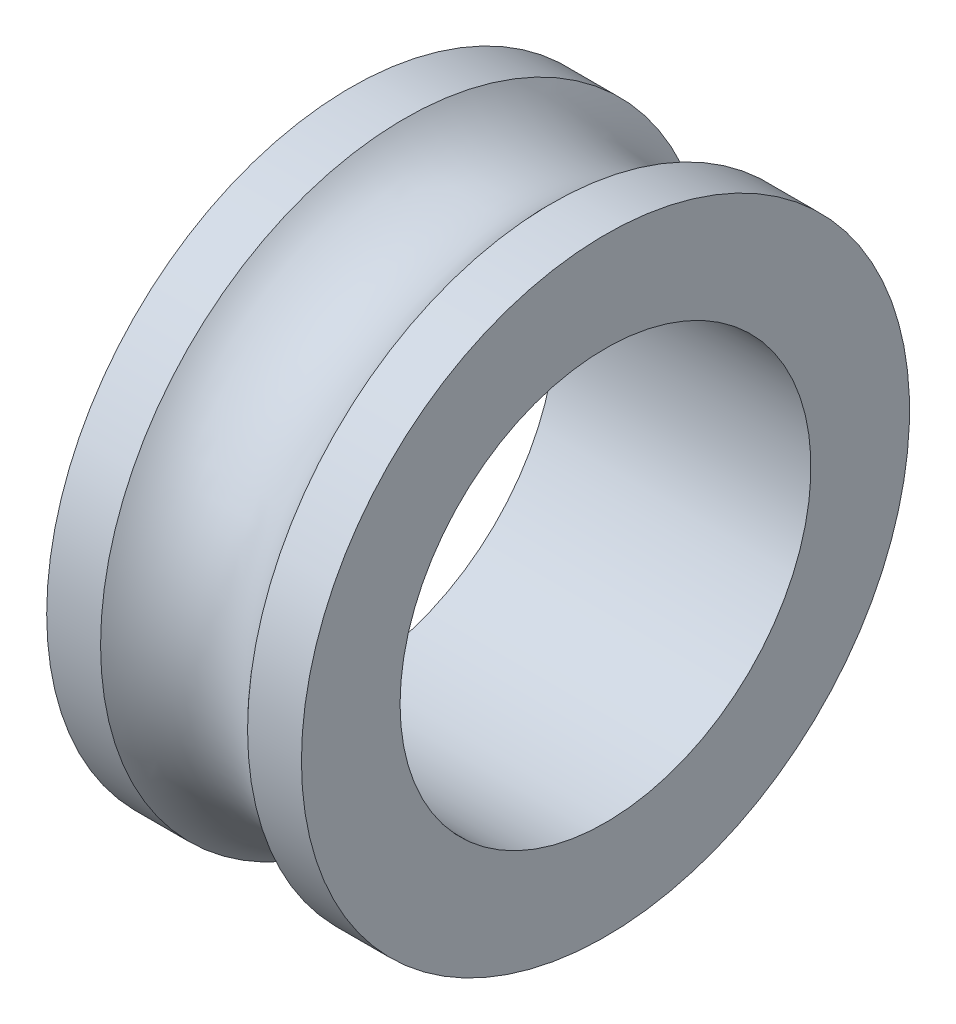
from build123d import *


with BuildPart() as part:
    # Sketch1 → Revolve1 (revolve)
    with BuildSketch(Plane.XY, mode=Mode.PRIVATE) as revolve1_sk:
        with BuildLine():
            Line((-15.5, 25), (15.5, 25))
            Line((15.5, 25), (15.5, 37))
            Line((15.5, 37), (8.94427191, 37))
            ThreePointArc((8.94427191, 37), (0, 33), (-8.94427191, 37))
            Line((-8.94427191, 37), (-15.5, 37))
            Line((-15.5, 37), (-15.5, 25))
        make_face()
    revolve(revolve1_sk.sketch.rotate(Axis((-14.42039801, 0, 0), (1, 0, 0)), 90), axis=Axis((-14.42039801, 0, 0), (1, 0, 0)))


solid = part.part
